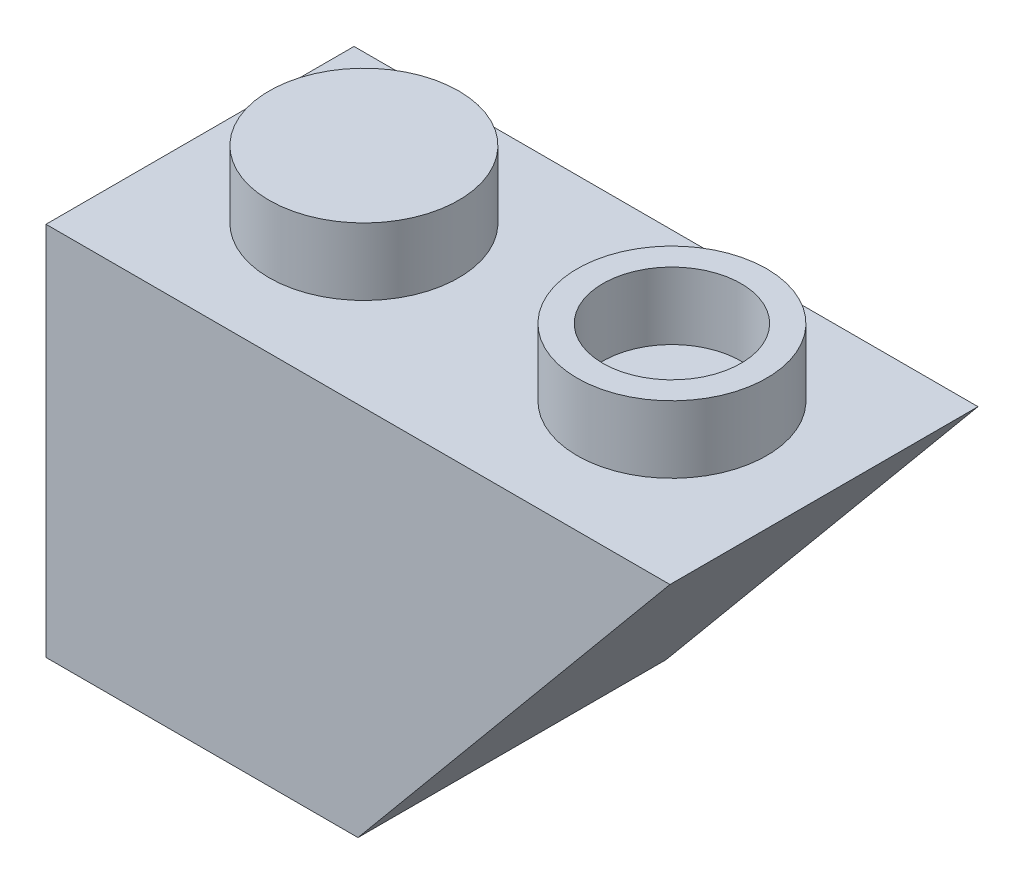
ISO-10303-21;
HEADER;
FILE_DESCRIPTION(('STEP AP214'),'2;1');
FILE_NAME('part.step','',(''),(''),'','','');
FILE_SCHEMA(('AUTOMOTIVE_DESIGN { 1 0 10303 214 1 1 1 1 }'));
ENDSEC;
DATA;
#1=APPLICATION_CONTEXT('core data for automotive mechanical design processes');
#2=APPLICATION_PROTOCOL_DEFINITION('international standard','automotive_design',2000,#1);
#3=PRODUCT_CONTEXT('',#1,'mechanical');
#4=PRODUCT('Part','Part','',(#3));
#5=PRODUCT_RELATED_PRODUCT_CATEGORY('part','',(#4));
#6=PRODUCT_DEFINITION_FORMATION('','',#4);
#7=PRODUCT_DEFINITION_CONTEXT('part definition',#1,'design');
#8=PRODUCT_DEFINITION('design','',#6,#7);
#9=PRODUCT_DEFINITION_SHAPE('','',#8);
#10=(LENGTH_UNIT() NAMED_UNIT(*) SI_UNIT(.MILLI.,.METRE.));
#11=(NAMED_UNIT(*) PLANE_ANGLE_UNIT() SI_UNIT($,.RADIAN.));
#12=(NAMED_UNIT(*) SI_UNIT($,.STERADIAN.) SOLID_ANGLE_UNIT());
#13=UNCERTAINTY_MEASURE_WITH_UNIT(LENGTH_MEASURE(1.E-05),#10,'distance_accuracy_value','');
#14=(GEOMETRIC_REPRESENTATION_CONTEXT(3) GLOBAL_UNCERTAINTY_ASSIGNED_CONTEXT((#13)) GLOBAL_UNIT_ASSIGNED_CONTEXT((#10,
#11,#12)) REPRESENTATION_CONTEXT('',''));
#15=CARTESIAN_POINT('',(0.,0.,0.));
#16=DIRECTION('',(0.,0.,1.));
#17=DIRECTION('',(1.,0.,0.));
#18=AXIS2_PLACEMENT_3D('',#15,#16,#17);
#19=CARTESIAN_POINT('',(3.9,11.2,-0.150000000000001));
#20=DIRECTION('',(0.,1.,0.));
#21=DIRECTION('',(0.,0.,1.));
#22=AXIS2_PLACEMENT_3D('',#19,#20,#21);
#23=PLANE('',#22);
#24=CARTESIAN_POINT('',(3.9,11.2,-0.150000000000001));
#25=DIRECTION('',(0.,1.,0.));
#26=DIRECTION('',(0.,0.,1.));
#27=AXIS2_PLACEMENT_3D('',#24,#25,#26);
#28=CIRCLE('',#27,2.4);
#29=CARTESIAN_POINT('',(3.9,11.2,2.25));
#30=VERTEX_POINT('',#29);
#31=EDGE_CURVE('E195',#30,#30,#28,.T.);
#32=ORIENTED_EDGE('',*,*,#31,.T.);
#33=EDGE_LOOP('',(#32));
#34=FACE_BOUND('',#33,.T.);
#35=CARTESIAN_POINT('',(3.9,11.2,-0.150000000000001));
#36=DIRECTION('',(0.,1.,0.));
#37=DIRECTION('',(0.,0.,1.));
#38=AXIS2_PLACEMENT_3D('',#35,#36,#37);
#39=CIRCLE('',#38,1.75);
#40=CARTESIAN_POINT('',(3.9,11.2,1.6));
#41=VERTEX_POINT('',#40);
#42=EDGE_CURVE('E41',#41,#41,#39,.F.);
#43=ORIENTED_EDGE('',*,*,#42,.T.);
#44=EDGE_LOOP('',(#43));
#45=FACE_BOUND('',#44,.T.);
#46=ADVANCED_FACE('F37',(#34,#45),#23,.T.);
#47=CARTESIAN_POINT('',(-7.9,9.5,-3.9));
#48=DIRECTION('',(0.,1.,0.));
#49=DIRECTION('',(0.,0.,1.));
#50=AXIS2_PLACEMENT_3D('',#47,#48,#49);
#51=PLANE('',#50);
#52=CARTESIAN_POINT('',(-3.9,9.5,-0.150000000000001));
#53=DIRECTION('',(0.,1.,0.));
#54=DIRECTION('',(0.,0.,1.));
#55=AXIS2_PLACEMENT_3D('',#52,#53,#54);
#56=CIRCLE('',#55,2.4);
#57=CARTESIAN_POINT('',(-3.9,9.5,2.25));
#58=VERTEX_POINT('',#57);
#59=EDGE_CURVE('E128',#58,#58,#56,.T.);
#60=ORIENTED_EDGE('',*,*,#59,.F.);
#61=EDGE_LOOP('',(#60));
#62=FACE_BOUND('',#61,.T.);
#63=DIRECTION('',(0.,0.,1.));
#64=VECTOR('',#63,1.);
#65=CARTESIAN_POINT('',(-7.9,9.5,3.9));
#66=LINE('',#65,#64);
#67=CARTESIAN_POINT('',(-7.9,9.5,-3.9));
#68=VERTEX_POINT('',#67);
#69=CARTESIAN_POINT('',(-7.9,9.5,3.9));
#70=VERTEX_POINT('',#69);
#71=EDGE_CURVE('E149',#68,#70,#66,.T.);
#72=ORIENTED_EDGE('',*,*,#71,.T.);
#73=DIRECTION('',(1.,0.,0.));
#74=VECTOR('',#73,1.);
#75=CARTESIAN_POINT('',(7.9,9.5,3.9));
#76=LINE('',#75,#74);
#77=CARTESIAN_POINT('',(7.9,9.5,3.9));
#78=VERTEX_POINT('',#77);
#79=EDGE_CURVE('E152',#70,#78,#76,.T.);
#80=ORIENTED_EDGE('',*,*,#79,.T.);
#81=DIRECTION('',(0.,0.,-1.));
#82=VECTOR('',#81,1.);
#83=CARTESIAN_POINT('',(7.9,9.5,3.9));
#84=LINE('',#83,#82);
#85=CARTESIAN_POINT('',(7.9,9.5,-3.9));
#86=VERTEX_POINT('',#85);
#87=EDGE_CURVE('E156',#78,#86,#84,.T.);
#88=ORIENTED_EDGE('',*,*,#87,.T.);
#89=DIRECTION('',(-1.,0.,0.));
#90=VECTOR('',#89,1.);
#91=CARTESIAN_POINT('',(7.9,9.5,-3.9));
#92=LINE('',#91,#90);
#93=EDGE_CURVE('E159',#86,#68,#92,.T.);
#94=ORIENTED_EDGE('',*,*,#93,.T.);
#95=EDGE_LOOP('',(#72,#80,#88,#94));
#96=FACE_BOUND('',#95,.T.);
#97=CARTESIAN_POINT('',(3.9,9.5,-0.150000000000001));
#98=DIRECTION('',(0.,1.,0.));
#99=DIRECTION('',(0.,0.,1.));
#100=AXIS2_PLACEMENT_3D('',#97,#98,#99);
#101=CIRCLE('',#100,2.4);
#102=CARTESIAN_POINT('',(3.9,9.5,2.25));
#103=VERTEX_POINT('',#102);
#104=EDGE_CURVE('E193',#103,#103,#101,.T.);
#105=ORIENTED_EDGE('',*,*,#104,.F.);
#106=EDGE_LOOP('',(#105));
#107=FACE_BOUND('',#106,.T.);
#108=ADVANCED_FACE('F186',(#62,#96,#107),#51,.T.);
#109=CARTESIAN_POINT('',(-7.9,9.5,3.9));
#110=DIRECTION('',(1.,0.,0.));
#111=DIRECTION('',(0.,0.,-1.));
#112=AXIS2_PLACEMENT_3D('',#109,#110,#111);
#113=PLANE('',#112);
#114=DIRECTION('',(0.,0.,1.));
#115=VECTOR('',#114,1.);
#116=CARTESIAN_POINT('',(-7.9,0.,3.9));
#117=LINE('',#116,#115);
#118=CARTESIAN_POINT('',(-7.9,0.,-3.9));
#119=VERTEX_POINT('',#118);
#120=CARTESIAN_POINT('',(-7.9,0.,3.9));
#121=VERTEX_POINT('',#120);
#122=EDGE_CURVE('E148',#119,#121,#117,.T.);
#123=ORIENTED_EDGE('',*,*,#122,.T.);
#124=DIRECTION('',(0.,-1.,0.));
#125=VECTOR('',#124,1.);
#126=CARTESIAN_POINT('',(-7.9,9.5,3.9));
#127=LINE('',#126,#125);
#128=EDGE_CURVE('E46',#70,#121,#127,.T.);
#129=ORIENTED_EDGE('',*,*,#128,.F.);
#130=ORIENTED_EDGE('',*,*,#71,.F.);
#131=DIRECTION('',(0.,-1.,0.));
#132=VECTOR('',#131,1.);
#133=CARTESIAN_POINT('',(-7.9,9.5,-3.9));
#134=LINE('',#133,#132);
#135=EDGE_CURVE('E161',#68,#119,#134,.T.);
#136=ORIENTED_EDGE('',*,*,#135,.T.);
#137=EDGE_LOOP('',(#123,#129,#130,#136));
#138=FACE_BOUND('',#137,.T.);
#139=ADVANCED_FACE('F39',(#138),#113,.F.);
#140=CARTESIAN_POINT('',(7.9,9.5,3.9));
#141=DIRECTION('',(0.,0.,-1.));
#142=DIRECTION('',(-1.,0.,0.));
#143=AXIS2_PLACEMENT_3D('',#140,#141,#142);
#144=PLANE('',#143);
#145=DIRECTION('',(1.,0.,0.));
#146=VECTOR('',#145,1.);
#147=CARTESIAN_POINT('',(7.9,0.,3.9));
#148=LINE('',#147,#146);
#149=CARTESIAN_POINT('',(0.,0.,3.9));
#150=VERTEX_POINT('',#149);
#151=EDGE_CURVE('E164',#121,#150,#148,.T.);
#152=ORIENTED_EDGE('',*,*,#151,.T.);
#153=DIRECTION('',(0.639387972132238,0.768884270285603,0.));
#154=VECTOR('',#153,1.);
#155=CARTESIAN_POINT('',(7.9,9.5,3.9));
#156=LINE('',#155,#154);
#157=EDGE_CURVE('E61',#150,#78,#156,.T.);
#158=ORIENTED_EDGE('',*,*,#157,.T.);
#159=ORIENTED_EDGE('',*,*,#79,.F.);
#160=ORIENTED_EDGE('',*,*,#128,.T.);
#161=EDGE_LOOP('',(#152,#158,#159,#160));
#162=FACE_BOUND('',#161,.T.);
#163=ADVANCED_FACE('F173',(#162),#144,.F.);
#164=CARTESIAN_POINT('',(7.9,9.5,-3.9));
#165=DIRECTION('',(0.,0.,1.));
#166=DIRECTION('',(1.,0.,0.));
#167=AXIS2_PLACEMENT_3D('',#164,#165,#166);
#168=PLANE('',#167);
#169=ORIENTED_EDGE('',*,*,#93,.F.);
#170=DIRECTION('',(-0.639387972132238,-0.768884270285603,0.));
#171=VECTOR('',#170,1.);
#172=CARTESIAN_POINT('',(7.9,9.5,-3.9));
#173=LINE('',#172,#171);
#174=CARTESIAN_POINT('',(0.,0.,-3.9));
#175=VERTEX_POINT('',#174);
#176=EDGE_CURVE('E141',#86,#175,#173,.T.);
#177=ORIENTED_EDGE('',*,*,#176,.T.);
#178=DIRECTION('',(-1.,0.,0.));
#179=VECTOR('',#178,1.);
#180=CARTESIAN_POINT('',(7.9,0.,-3.9));
#181=LINE('',#180,#179);
#182=EDGE_CURVE('E153',#175,#119,#181,.T.);
#183=ORIENTED_EDGE('',*,*,#182,.T.);
#184=ORIENTED_EDGE('',*,*,#135,.F.);
#185=EDGE_LOOP('',(#169,#177,#183,#184));
#186=FACE_BOUND('',#185,.T.);
#187=ADVANCED_FACE('F184',(#186),#168,.F.);
#188=CARTESIAN_POINT('',(-7.9,0.,-3.9));
#189=DIRECTION('',(0.,1.,0.));
#190=DIRECTION('',(0.,0.,1.));
#191=AXIS2_PLACEMENT_3D('',#188,#189,#190);
#192=PLANE('',#191);
#193=DIRECTION('',(1.,0.,0.));
#194=VECTOR('',#193,1.);
#195=CARTESIAN_POINT('',(-6.4,0.,-2.4));
#196=LINE('',#195,#194);
#197=CARTESIAN_POINT('',(-6.4,0.,-2.4));
#198=VERTEX_POINT('',#197);
#199=CARTESIAN_POINT('',(-1.6,0.,-2.4));
#200=VERTEX_POINT('',#199);
#201=EDGE_CURVE('E134',#198,#200,#196,.T.);
#202=ORIENTED_EDGE('',*,*,#201,.F.);
#203=DIRECTION('',(0.,0.,-1.));
#204=VECTOR('',#203,1.);
#205=CARTESIAN_POINT('',(-6.4,0.,2.4));
#206=LINE('',#205,#204);
#207=CARTESIAN_POINT('',(-6.4,0.,2.4));
#208=VERTEX_POINT('',#207);
#209=EDGE_CURVE('E53',#208,#198,#206,.T.);
#210=ORIENTED_EDGE('',*,*,#209,.F.);
#211=DIRECTION('',(-1.,0.,0.));
#212=VECTOR('',#211,1.);
#213=CARTESIAN_POINT('',(-6.4,0.,2.4));
#214=LINE('',#213,#212);
#215=CARTESIAN_POINT('',(-1.6,0.,2.4));
#216=VERTEX_POINT('',#215);
#217=EDGE_CURVE('E122',#216,#208,#214,.T.);
#218=ORIENTED_EDGE('',*,*,#217,.F.);
#219=DIRECTION('',(0.,0.,1.));
#220=VECTOR('',#219,1.);
#221=CARTESIAN_POINT('',(-1.6,0.,2.4));
#222=LINE('',#221,#220);
#223=EDGE_CURVE('E125',#200,#216,#222,.T.);
#224=ORIENTED_EDGE('',*,*,#223,.F.);
#225=EDGE_LOOP('',(#202,#210,#218,#224));
#226=FACE_BOUND('',#225,.T.);
#227=ORIENTED_EDGE('',*,*,#182,.F.);
#228=DIRECTION('',(0.,0.,1.));
#229=VECTOR('',#228,1.);
#230=CARTESIAN_POINT('',(0.,0.,-3.9));
#231=LINE('',#230,#229);
#232=EDGE_CURVE('E11',#175,#150,#231,.T.);
#233=ORIENTED_EDGE('',*,*,#232,.T.);
#234=ORIENTED_EDGE('',*,*,#151,.F.);
#235=ORIENTED_EDGE('',*,*,#122,.F.);
#236=EDGE_LOOP('',(#227,#233,#234,#235));
#237=FACE_BOUND('',#236,.T.);
#238=ADVANCED_FACE('F180',(#226,#237),#192,.F.);
#239=CARTESIAN_POINT('',(7.89999999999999,9.5,-38.6728021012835));
#240=DIRECTION('',(-0.768884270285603,0.639387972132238,0.));
#241=DIRECTION('',(-0.639387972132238,-0.768884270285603,0.));
#242=AXIS2_PLACEMENT_3D('',#239,#240,#241);
#243=PLANE('',#242);
#244=ORIENTED_EDGE('',*,*,#157,.F.);
#245=ORIENTED_EDGE('',*,*,#232,.F.);
#246=ORIENTED_EDGE('',*,*,#176,.F.);
#247=ORIENTED_EDGE('',*,*,#87,.F.);
#248=EDGE_LOOP('',(#244,#245,#246,#247));
#249=FACE_BOUND('',#248,.T.);
#250=ADVANCED_FACE('F181',(#249),#243,.F.);
#251=CARTESIAN_POINT('',(-6.4,6.6,2.4));
#252=DIRECTION('',(-1.,0.,0.));
#253=DIRECTION('',(0.,0.,1.));
#254=AXIS2_PLACEMENT_3D('',#251,#252,#253);
#255=PLANE('',#254);
#256=ORIENTED_EDGE('',*,*,#209,.T.);
#257=DIRECTION('',(0.,-1.,0.));
#258=VECTOR('',#257,1.);
#259=CARTESIAN_POINT('',(-6.4,6.6,-2.4));
#260=LINE('',#259,#258);
#261=CARTESIAN_POINT('',(-6.4,6.6,-2.4));
#262=VERTEX_POINT('',#261);
#263=EDGE_CURVE('E100',#262,#198,#260,.T.);
#264=ORIENTED_EDGE('',*,*,#263,.F.);
#265=DIRECTION('',(0.,0.,-1.));
#266=VECTOR('',#265,1.);
#267=CARTESIAN_POINT('',(-6.4,6.6,2.4));
#268=LINE('',#267,#266);
#269=CARTESIAN_POINT('',(-6.4,6.6,2.4));
#270=VERTEX_POINT('',#269);
#271=EDGE_CURVE('E104',#270,#262,#268,.T.);
#272=ORIENTED_EDGE('',*,*,#271,.F.);
#273=DIRECTION('',(0.,-1.,0.));
#274=VECTOR('',#273,1.);
#275=CARTESIAN_POINT('',(-6.4,6.6,2.4));
#276=LINE('',#275,#274);
#277=EDGE_CURVE('E139',#270,#208,#276,.T.);
#278=ORIENTED_EDGE('',*,*,#277,.T.);
#279=EDGE_LOOP('',(#256,#264,#272,#278));
#280=FACE_BOUND('',#279,.T.);
#281=ADVANCED_FACE('F102',(#280),#255,.F.);
#282=CARTESIAN_POINT('',(-6.4,6.6,2.4));
#283=DIRECTION('',(0.,0.,1.));
#284=DIRECTION('',(1.,0.,0.));
#285=AXIS2_PLACEMENT_3D('',#282,#283,#284);
#286=PLANE('',#285);
#287=ORIENTED_EDGE('',*,*,#217,.T.);
#288=ORIENTED_EDGE('',*,*,#277,.F.);
#289=DIRECTION('',(-1.,0.,0.));
#290=VECTOR('',#289,1.);
#291=CARTESIAN_POINT('',(-6.4,6.6,2.4));
#292=LINE('',#291,#290);
#293=CARTESIAN_POINT('',(-1.6,6.6,2.4));
#294=VERTEX_POINT('',#293);
#295=EDGE_CURVE('E110',#294,#270,#292,.T.);
#296=ORIENTED_EDGE('',*,*,#295,.F.);
#297=DIRECTION('',(0.,-1.,0.));
#298=VECTOR('',#297,1.);
#299=CARTESIAN_POINT('',(-1.6,6.6,2.4));
#300=LINE('',#299,#298);
#301=EDGE_CURVE('E142',#294,#216,#300,.T.);
#302=ORIENTED_EDGE('',*,*,#301,.T.);
#303=EDGE_LOOP('',(#287,#288,#296,#302));
#304=FACE_BOUND('',#303,.T.);
#305=ADVANCED_FACE('F301',(#304),#286,.F.);
#306=CARTESIAN_POINT('',(-1.6,6.6,2.4));
#307=DIRECTION('',(1.,0.,0.));
#308=DIRECTION('',(0.,0.,-1.));
#309=AXIS2_PLACEMENT_3D('',#306,#307,#308);
#310=PLANE('',#309);
#311=ORIENTED_EDGE('',*,*,#223,.T.);
#312=ORIENTED_EDGE('',*,*,#301,.F.);
#313=DIRECTION('',(0.,0.,1.));
#314=VECTOR('',#313,1.);
#315=CARTESIAN_POINT('',(-1.6,6.6,2.4));
#316=LINE('',#315,#314);
#317=CARTESIAN_POINT('',(-1.6,6.6,-2.4));
#318=VERTEX_POINT('',#317);
#319=EDGE_CURVE('E118',#318,#294,#316,.T.);
#320=ORIENTED_EDGE('',*,*,#319,.F.);
#321=DIRECTION('',(0.,-1.,0.));
#322=VECTOR('',#321,1.);
#323=CARTESIAN_POINT('',(-1.6,6.6,-2.4));
#324=LINE('',#323,#322);
#325=EDGE_CURVE('E109',#318,#200,#324,.T.);
#326=ORIENTED_EDGE('',*,*,#325,.T.);
#327=EDGE_LOOP('',(#311,#312,#320,#326));
#328=FACE_BOUND('',#327,.T.);
#329=ADVANCED_FACE('F292',(#328),#310,.F.);
#330=CARTESIAN_POINT('',(-6.4,6.6,-2.4));
#331=DIRECTION('',(0.,0.,-1.));
#332=DIRECTION('',(-1.,0.,0.));
#333=AXIS2_PLACEMENT_3D('',#330,#331,#332);
#334=PLANE('',#333);
#335=ORIENTED_EDGE('',*,*,#201,.T.);
#336=ORIENTED_EDGE('',*,*,#325,.F.);
#337=DIRECTION('',(1.,0.,0.));
#338=VECTOR('',#337,1.);
#339=CARTESIAN_POINT('',(-6.4,6.6,-2.4));
#340=LINE('',#339,#338);
#341=EDGE_CURVE('E113',#262,#318,#340,.T.);
#342=ORIENTED_EDGE('',*,*,#341,.F.);
#343=ORIENTED_EDGE('',*,*,#263,.T.);
#344=EDGE_LOOP('',(#335,#336,#342,#343));
#345=FACE_BOUND('',#344,.T.);
#346=ADVANCED_FACE('F114',(#345),#334,.F.);
#347=CARTESIAN_POINT('',(-6.4,6.6,-2.4));
#348=DIRECTION('',(0.,-1.,0.));
#349=DIRECTION('',(0.,0.,-1.));
#350=AXIS2_PLACEMENT_3D('',#347,#348,#349);
#351=PLANE('',#350);
#352=ORIENTED_EDGE('',*,*,#271,.T.);
#353=ORIENTED_EDGE('',*,*,#341,.T.);
#354=ORIENTED_EDGE('',*,*,#319,.T.);
#355=ORIENTED_EDGE('',*,*,#295,.T.);
#356=EDGE_LOOP('',(#352,#353,#354,#355));
#357=FACE_BOUND('',#356,.T.);
#358=ADVANCED_FACE('F120',(#357),#351,.T.);
#359=CARTESIAN_POINT('',(-3.9,11.2,-0.150000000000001));
#360=DIRECTION('',(0.,-1.,0.));
#361=DIRECTION('',(0.,0.,-1.));
#362=AXIS2_PLACEMENT_3D('',#359,#360,#361);
#363=CYLINDRICAL_SURFACE('',#362,2.4);
#364=CARTESIAN_POINT('',(-3.9,11.2,-0.150000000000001));
#365=DIRECTION('',(0.,1.,0.));
#366=DIRECTION('',(0.,0.,1.));
#367=AXIS2_PLACEMENT_3D('',#364,#365,#366);
#368=CIRCLE('',#367,2.4);
#369=CARTESIAN_POINT('',(-3.9,11.2,2.25));
#370=VERTEX_POINT('',#369);
#371=EDGE_CURVE('E135',#370,#370,#368,.T.);
#372=ORIENTED_EDGE('',*,*,#371,.F.);
#373=EDGE_LOOP('',(#372));
#374=FACE_BOUND('',#373,.T.);
#375=ORIENTED_EDGE('',*,*,#59,.T.);
#376=EDGE_LOOP('',(#375));
#377=FACE_BOUND('',#376,.T.);
#378=ADVANCED_FACE('F208',(#374,#377),#363,.T.);
#379=CARTESIAN_POINT('',(-3.9,11.2,-0.150000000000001));
#380=DIRECTION('',(0.,1.,0.));
#381=DIRECTION('',(0.,0.,1.));
#382=AXIS2_PLACEMENT_3D('',#379,#380,#381);
#383=PLANE('',#382);
#384=ORIENTED_EDGE('',*,*,#371,.T.);
#385=EDGE_LOOP('',(#384));
#386=FACE_BOUND('',#385,.T.);
#387=ADVANCED_FACE('F210',(#386),#383,.T.);
#388=CARTESIAN_POINT('',(3.9,11.2,-0.150000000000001));
#389=DIRECTION('',(0.,-1.,0.));
#390=DIRECTION('',(0.,0.,-1.));
#391=AXIS2_PLACEMENT_3D('',#388,#389,#390);
#392=CYLINDRICAL_SURFACE('',#391,2.4);
#393=ORIENTED_EDGE('',*,*,#31,.F.);
#394=EDGE_LOOP('',(#393));
#395=FACE_BOUND('',#394,.T.);
#396=ORIENTED_EDGE('',*,*,#104,.T.);
#397=EDGE_LOOP('',(#396));
#398=FACE_BOUND('',#397,.T.);
#399=ADVANCED_FACE('F217',(#395,#398),#392,.T.);
#400=CARTESIAN_POINT('',(3.9,13.5,-0.150000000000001));
#401=DIRECTION('',(0.,-1.,0.));
#402=DIRECTION('',(0.,0.,-1.));
#403=AXIS2_PLACEMENT_3D('',#400,#401,#402);
#404=CYLINDRICAL_SURFACE('',#403,1.75);
#405=ORIENTED_EDGE('',*,*,#42,.F.);
#406=EDGE_LOOP('',(#405));
#407=FACE_BOUND('',#406,.T.);
#408=CARTESIAN_POINT('',(3.9,9.5,-0.150000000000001));
#409=DIRECTION('',(0.,1.,0.));
#410=DIRECTION('',(0.,0.,1.));
#411=AXIS2_PLACEMENT_3D('',#408,#409,#410);
#412=CIRCLE('',#411,1.75);
#413=CARTESIAN_POINT('',(3.9,9.5,1.6));
#414=VERTEX_POINT('',#413);
#415=EDGE_CURVE('E200',#414,#414,#412,.T.);
#416=ORIENTED_EDGE('',*,*,#415,.F.);
#417=EDGE_LOOP('',(#416));
#418=FACE_BOUND('',#417,.T.);
#419=ADVANCED_FACE('F228',(#407,#418),#404,.F.);
#420=CARTESIAN_POINT('',(3.9,9.5,-0.150000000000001));
#421=DIRECTION('',(0.,1.,0.));
#422=DIRECTION('',(0.,0.,1.));
#423=AXIS2_PLACEMENT_3D('',#420,#421,#422);
#424=PLANE('',#423);
#425=ORIENTED_EDGE('',*,*,#415,.T.);
#426=EDGE_LOOP('',(#425));
#427=FACE_BOUND('',#426,.T.);
#428=ADVANCED_FACE('F235',(#427),#424,.T.);
#429=CLOSED_SHELL('',(#46,#108,#139,#163,#187,#238,#250,#281,#305,#329,#346,#358,#378,#387,#399,
#419,#428));
#430=MANIFOLD_SOLID_BREP('B2',#429);
#431=ADVANCED_BREP_SHAPE_REPRESENTATION('',(#18,#430),#14);
#432=SHAPE_DEFINITION_REPRESENTATION(#9,#431);
ENDSEC;
END-ISO-10303-21;
